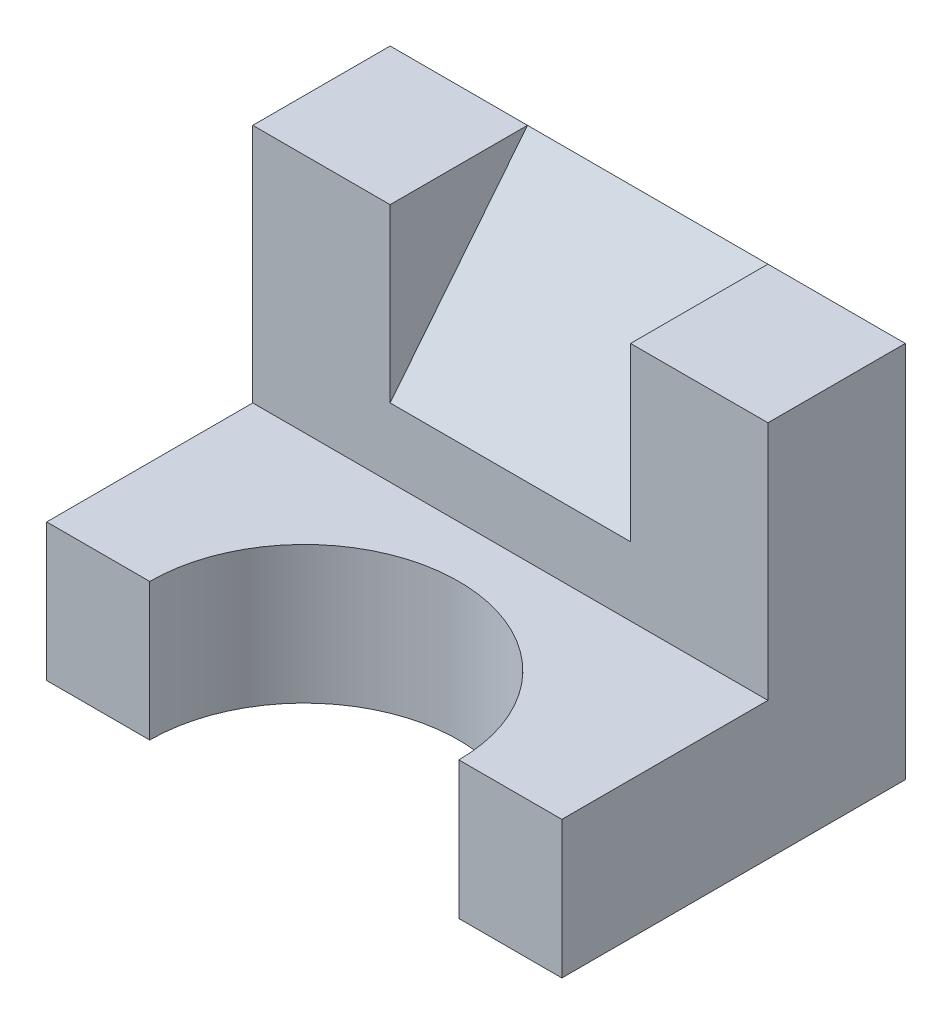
from build123d import *

# Parameters (mm, degrees)
SKETCH_1_W          = 30
SKETCH_1_H          = 20
EXTRUDE_1_DEPTH     = 8
SKETCH_2_W          = 30
SKETCH_2_H          = 8
EXTRUDE_2_DEPTH     = 14
SKETCH_3_R          = 9
CUT_EXTRUDE_1_DEPTH = 39.678159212
CUT_EXTRUDE_2_DEPTH = 14


with BuildPart() as part:
    # Sketch 1 → Extrude 1 (new body)
    with BuildSketch(Plane(origin=(0, 0, 0), x_dir=(1, 0, 0), z_dir=(0, 1, 0))):
        with Locations((15, 10)):
            Rectangle(SKETCH_1_W, SKETCH_1_H)
    extrude(amount=EXTRUDE_1_DEPTH)

    # Sketch 2 → Extrude 2 (add)
    with BuildSketch(Plane(origin=(0, 8, 0), x_dir=(1, 0, 0), z_dir=(0, 1, 0))):
        with Locations((15, 16)):
            Rectangle(SKETCH_2_W, SKETCH_2_H)
    extrude(amount=EXTRUDE_2_DEPTH)

    # Sketch 3 → Cut-Extrude 1 (cut, through all)
    with BuildSketch(Plane(origin=(0, 8, 0), x_dir=(1, 0, 0), z_dir=(0, 1, 0))):
        with Locations((15, 0)):
            Circle(SKETCH_3_R)
    extrude(amount=-CUT_EXTRUDE_1_DEPTH, mode=Mode.SUBTRACT)

    # Sketch 4 → Cut-Extrude 2 (cut)
    with BuildSketch(Plane(origin=(8, 0, 0), x_dir=(0, 0, -1), z_dir=(1, 0, 0))):
        Polygon((12, 22), (20, 22), (12, 12), align=None)
    extrude(amount=CUT_EXTRUDE_2_DEPTH, mode=Mode.SUBTRACT)


solid = part.part
